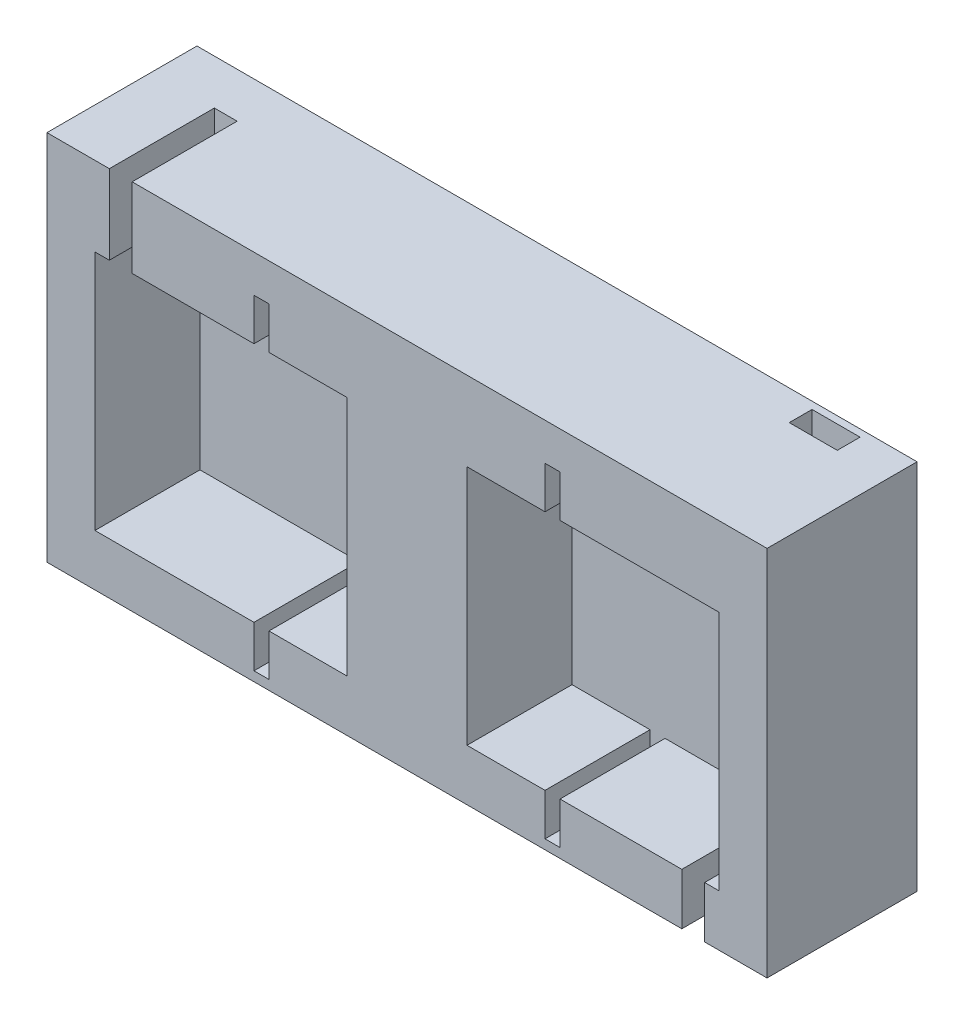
ISO-10303-21;
HEADER;
FILE_DESCRIPTION(('STEP AP214'),'2;1');
FILE_NAME('part.step','',(''),(''),'','','');
FILE_SCHEMA(('AUTOMOTIVE_DESIGN { 1 0 10303 214 1 1 1 1 }'));
ENDSEC;
DATA;
#1=APPLICATION_CONTEXT('core data for automotive mechanical design processes');
#2=APPLICATION_PROTOCOL_DEFINITION('international standard','automotive_design',2000,#1);
#3=PRODUCT_CONTEXT('',#1,'mechanical');
#4=PRODUCT('Part','Part','',(#3));
#5=PRODUCT_RELATED_PRODUCT_CATEGORY('part','',(#4));
#6=PRODUCT_DEFINITION_FORMATION('','',#4);
#7=PRODUCT_DEFINITION_CONTEXT('part definition',#1,'design');
#8=PRODUCT_DEFINITION('design','',#6,#7);
#9=PRODUCT_DEFINITION_SHAPE('','',#8);
#10=(LENGTH_UNIT() NAMED_UNIT(*) SI_UNIT(.MILLI.,.METRE.));
#11=(NAMED_UNIT(*) PLANE_ANGLE_UNIT() SI_UNIT($,.RADIAN.));
#12=(NAMED_UNIT(*) SI_UNIT($,.STERADIAN.) SOLID_ANGLE_UNIT());
#13=UNCERTAINTY_MEASURE_WITH_UNIT(LENGTH_MEASURE(1.E-05),#10,'distance_accuracy_value','');
#14=(GEOMETRIC_REPRESENTATION_CONTEXT(3) GLOBAL_UNCERTAINTY_ASSIGNED_CONTEXT((#13)) GLOBAL_UNIT_ASSIGNED_CONTEXT((#10,
#11,#12)) REPRESENTATION_CONTEXT('',''));
#15=CARTESIAN_POINT('',(0.,0.,0.));
#16=DIRECTION('',(0.,0.,1.));
#17=DIRECTION('',(1.,0.,0.));
#18=AXIS2_PLACEMENT_3D('',#15,#16,#17);
#19=CARTESIAN_POINT('',(51.7,-31.,-7.5));
#20=DIRECTION('',(1.,0.,0.));
#21=DIRECTION('',(0.,0.,-1.));
#22=AXIS2_PLACEMENT_3D('',#19,#20,#21);
#23=PLANE('',#22);
#24=DIRECTION('',(0.,-1.,0.));
#25=VECTOR('',#24,1.);
#26=CARTESIAN_POINT('',(51.7,31.,-11.3));
#27=LINE('',#26,#25);
#28=CARTESIAN_POINT('',(51.7,31.,-11.3));
#29=VERTEX_POINT('',#28);
#30=CARTESIAN_POINT('',(51.7,-31.,-11.3));
#31=VERTEX_POINT('',#30);
#32=EDGE_CURVE('E63',#29,#31,#27,.T.);
#33=ORIENTED_EDGE('',*,*,#32,.T.);
#34=DIRECTION('',(0.,0.,-1.));
#35=VECTOR('',#34,1.);
#36=CARTESIAN_POINT('',(51.7,-31.,-7.5));
#37=LINE('',#36,#35);
#38=CARTESIAN_POINT('',(51.7,-31.,-7.5));
#39=VERTEX_POINT('',#38);
#40=EDGE_CURVE('E368',#39,#31,#37,.T.);
#41=ORIENTED_EDGE('',*,*,#40,.F.);
#42=DIRECTION('',(0.,-1.,0.));
#43=VECTOR('',#42,1.);
#44=CARTESIAN_POINT('',(51.7,-31.,-7.5));
#45=LINE('',#44,#43);
#46=CARTESIAN_POINT('',(51.7,31.,-7.5));
#47=VERTEX_POINT('',#46);
#48=EDGE_CURVE('E339',#47,#39,#45,.T.);
#49=ORIENTED_EDGE('',*,*,#48,.F.);
#50=DIRECTION('',(0.,0.,-1.));
#51=VECTOR('',#50,1.);
#52=CARTESIAN_POINT('',(51.7,31.,-7.5));
#53=LINE('',#52,#51);
#54=EDGE_CURVE('E58',#47,#29,#53,.T.);
#55=ORIENTED_EDGE('',*,*,#54,.T.);
#56=EDGE_LOOP('',(#33,#41,#49,#55));
#57=FACE_BOUND('',#56,.T.);
#58=ADVANCED_FACE('F41',(#57),#23,.F.);
#59=CARTESIAN_POINT('',(43.7,31.,-7.5));
#60=DIRECTION('',(-1.,0.,0.));
#61=DIRECTION('',(0.,-1.,0.));
#62=AXIS2_PLACEMENT_3D('',#59,#60,#61);
#63=PLANE('',#62);
#64=DIRECTION('',(0.,1.,0.));
#65=VECTOR('',#64,1.);
#66=CARTESIAN_POINT('',(43.7,-31.,-11.3));
#67=LINE('',#66,#65);
#68=CARTESIAN_POINT('',(43.7,-31.,-11.3));
#69=VERTEX_POINT('',#68);
#70=CARTESIAN_POINT('',(43.7,31.,-11.3));
#71=VERTEX_POINT('',#70);
#72=EDGE_CURVE('E1329',#69,#71,#67,.T.);
#73=ORIENTED_EDGE('',*,*,#72,.T.);
#74=DIRECTION('',(0.,0.,-1.));
#75=VECTOR('',#74,1.);
#76=CARTESIAN_POINT('',(43.7,31.,-7.5));
#77=LINE('',#76,#75);
#78=CARTESIAN_POINT('',(43.7,31.,-7.5));
#79=VERTEX_POINT('',#78);
#80=EDGE_CURVE('E330',#79,#71,#77,.T.);
#81=ORIENTED_EDGE('',*,*,#80,.F.);
#82=DIRECTION('',(0.,1.,0.));
#83=VECTOR('',#82,1.);
#84=CARTESIAN_POINT('',(43.7,31.,-7.5));
#85=LINE('',#84,#83);
#86=CARTESIAN_POINT('',(43.7,-31.,-7.5));
#87=VERTEX_POINT('',#86);
#88=EDGE_CURVE('E323',#87,#79,#85,.T.);
#89=ORIENTED_EDGE('',*,*,#88,.F.);
#90=DIRECTION('',(0.,0.,-1.));
#91=VECTOR('',#90,1.);
#92=CARTESIAN_POINT('',(43.7,-31.,-7.5));
#93=LINE('',#92,#91);
#94=EDGE_CURVE('E327',#87,#69,#93,.T.);
#95=ORIENTED_EDGE('',*,*,#94,.T.);
#96=EDGE_LOOP('',(#73,#81,#89,#95));
#97=FACE_BOUND('',#96,.T.);
#98=ADVANCED_FACE('F325',(#97),#63,.F.);
#99=CARTESIAN_POINT('',(0.,31.,-12.5));
#100=DIRECTION('',(0.,-1.,0.));
#101=DIRECTION('',(0.,0.,-1.));
#102=AXIS2_PLACEMENT_3D('',#99,#100,#101);
#103=PLANE('',#102);
#104=DIRECTION('',(0.,0.,1.));
#105=VECTOR('',#104,1.);
#106=CARTESIAN_POINT('',(60.,31.,-12.5));
#107=LINE('',#106,#105);
#108=CARTESIAN_POINT('',(60.,31.,-12.5));
#109=VERTEX_POINT('',#108);
#110=CARTESIAN_POINT('',(60.,31.,12.5));
#111=VERTEX_POINT('',#110);
#112=EDGE_CURVE('E50',#109,#111,#107,.T.);
#113=ORIENTED_EDGE('',*,*,#112,.F.);
#114=DIRECTION('',(1.,0.,0.));
#115=VECTOR('',#114,1.);
#116=CARTESIAN_POINT('',(0.,31.,-12.5));
#117=LINE('',#116,#115);
#118=CARTESIAN_POINT('',(-60.,31.,-12.5));
#119=VERTEX_POINT('',#118);
#120=EDGE_CURVE('E630',#119,#109,#117,.T.);
#121=ORIENTED_EDGE('',*,*,#120,.F.);
#122=DIRECTION('',(0.,0.,1.));
#123=VECTOR('',#122,1.);
#124=CARTESIAN_POINT('',(-60.,31.,-12.5));
#125=LINE('',#124,#123);
#126=CARTESIAN_POINT('',(-60.,31.,12.5));
#127=VERTEX_POINT('',#126);
#128=EDGE_CURVE('E11',#119,#127,#125,.T.);
#129=ORIENTED_EDGE('',*,*,#128,.T.);
#130=DIRECTION('',(1.,0.,0.));
#131=VECTOR('',#130,1.);
#132=CARTESIAN_POINT('',(0.,31.,12.5));
#133=LINE('',#132,#131);
#134=CARTESIAN_POINT('',(-49.6,31.,12.5));
#135=VERTEX_POINT('',#134);
#136=EDGE_CURVE('E625',#127,#135,#133,.T.);
#137=ORIENTED_EDGE('',*,*,#136,.T.);
#138=DIRECTION('',(0.,0.,-1.));
#139=VECTOR('',#138,1.);
#140=CARTESIAN_POINT('',(-49.6,31.,12.5));
#141=LINE('',#140,#139);
#142=CARTESIAN_POINT('',(-49.6,31.,-5.));
#143=VERTEX_POINT('',#142);
#144=EDGE_CURVE('E492',#135,#143,#141,.T.);
#145=ORIENTED_EDGE('',*,*,#144,.T.);
#146=DIRECTION('',(1.,0.,0.));
#147=VECTOR('',#146,1.);
#148=CARTESIAN_POINT('',(0.,31.,-5.));
#149=LINE('',#148,#147);
#150=CARTESIAN_POINT('',(-45.8,31.,-5.));
#151=VERTEX_POINT('',#150);
#152=EDGE_CURVE('E393',#143,#151,#149,.T.);
#153=ORIENTED_EDGE('',*,*,#152,.T.);
#154=DIRECTION('',(0.,0.,-1.));
#155=VECTOR('',#154,1.);
#156=CARTESIAN_POINT('',(-45.8,31.,12.5));
#157=LINE('',#156,#155);
#158=CARTESIAN_POINT('',(-45.8,31.,12.5));
#159=VERTEX_POINT('',#158);
#160=EDGE_CURVE('E495',#159,#151,#157,.T.);
#161=ORIENTED_EDGE('',*,*,#160,.F.);
#162=EDGE_CURVE('E641',#159,#111,#133,.T.);
#163=ORIENTED_EDGE('',*,*,#162,.T.);
#164=EDGE_LOOP('',(#113,#121,#129,#137,#145,#153,#161,#163));
#165=FACE_BOUND('',#164,.T.);
#166=DIRECTION('',(1.,0.,0.));
#167=VECTOR('',#166,1.);
#168=CARTESIAN_POINT('',(43.7,31.,-11.3));
#169=LINE('',#168,#167);
#170=EDGE_CURVE('E1328',#71,#29,#169,.T.);
#171=ORIENTED_EDGE('',*,*,#170,.T.);
#172=ORIENTED_EDGE('',*,*,#54,.F.);
#173=DIRECTION('',(1.,0.,0.));
#174=VECTOR('',#173,1.);
#175=CARTESIAN_POINT('',(51.7,31.,-7.5));
#176=LINE('',#175,#174);
#177=EDGE_CURVE('E333',#79,#47,#176,.T.);
#178=ORIENTED_EDGE('',*,*,#177,.F.);
#179=ORIENTED_EDGE('',*,*,#80,.T.);
#180=EDGE_LOOP('',(#171,#172,#178,#179));
#181=FACE_BOUND('',#180,.T.);
#182=ADVANCED_FACE('F738',(#165,#181),#103,.F.);
#183=CARTESIAN_POINT('',(0.,-31.,-12.5));
#184=DIRECTION('',(0.,-1.,0.));
#185=DIRECTION('',(0.,0.,-1.));
#186=AXIS2_PLACEMENT_3D('',#183,#184,#185);
#187=PLANE('',#186);
#188=DIRECTION('',(1.,0.,0.));
#189=VECTOR('',#188,1.);
#190=CARTESIAN_POINT('',(0.,-31.,-12.5));
#191=LINE('',#190,#189);
#192=CARTESIAN_POINT('',(-60.,-31.,-12.5));
#193=VERTEX_POINT('',#192);
#194=CARTESIAN_POINT('',(60.,-31.,-12.5));
#195=VERTEX_POINT('',#194);
#196=EDGE_CURVE('E624',#193,#195,#191,.T.);
#197=ORIENTED_EDGE('',*,*,#196,.T.);
#198=DIRECTION('',(0.,0.,1.));
#199=VECTOR('',#198,1.);
#200=CARTESIAN_POINT('',(60.,-31.,-12.5));
#201=LINE('',#200,#199);
#202=CARTESIAN_POINT('',(60.,-31.,12.5));
#203=VERTEX_POINT('',#202);
#204=EDGE_CURVE('E645',#195,#203,#201,.T.);
#205=ORIENTED_EDGE('',*,*,#204,.T.);
#206=DIRECTION('',(1.,0.,0.));
#207=VECTOR('',#206,1.);
#208=CARTESIAN_POINT('',(0.,-31.,12.5));
#209=LINE('',#208,#207);
#210=CARTESIAN_POINT('',(49.6,-31.,12.5));
#211=VERTEX_POINT('',#210);
#212=EDGE_CURVE('E634',#211,#203,#209,.T.);
#213=ORIENTED_EDGE('',*,*,#212,.F.);
#214=DIRECTION('',(0.,0.,-1.));
#215=VECTOR('',#214,1.);
#216=CARTESIAN_POINT('',(49.6,-31.,12.5));
#217=LINE('',#216,#215);
#218=CARTESIAN_POINT('',(49.6,-31.,-5.));
#219=VERTEX_POINT('',#218);
#220=EDGE_CURVE('E615',#211,#219,#217,.T.);
#221=ORIENTED_EDGE('',*,*,#220,.T.);
#222=DIRECTION('',(1.,0.,0.));
#223=VECTOR('',#222,1.);
#224=CARTESIAN_POINT('',(0.,-31.,-5.));
#225=LINE('',#224,#223);
#226=CARTESIAN_POINT('',(45.8,-31.,-5.));
#227=VERTEX_POINT('',#226);
#228=EDGE_CURVE('E505',#227,#219,#225,.T.);
#229=ORIENTED_EDGE('',*,*,#228,.F.);
#230=DIRECTION('',(0.,0.,-1.));
#231=VECTOR('',#230,1.);
#232=CARTESIAN_POINT('',(45.8,-31.,12.5));
#233=LINE('',#232,#231);
#234=CARTESIAN_POINT('',(45.8,-31.,12.5));
#235=VERTEX_POINT('',#234);
#236=EDGE_CURVE('E618',#235,#227,#233,.T.);
#237=ORIENTED_EDGE('',*,*,#236,.F.);
#238=CARTESIAN_POINT('',(-60.,-31.,12.5));
#239=VERTEX_POINT('',#238);
#240=EDGE_CURVE('E635',#239,#235,#209,.T.);
#241=ORIENTED_EDGE('',*,*,#240,.F.);
#242=DIRECTION('',(0.,0.,1.));
#243=VECTOR('',#242,1.);
#244=CARTESIAN_POINT('',(-60.,-31.,-12.5));
#245=LINE('',#244,#243);
#246=EDGE_CURVE('E45',#193,#239,#245,.T.);
#247=ORIENTED_EDGE('',*,*,#246,.F.);
#248=EDGE_LOOP('',(#197,#205,#213,#221,#229,#237,#241,#247));
#249=FACE_BOUND('',#248,.T.);
#250=ORIENTED_EDGE('',*,*,#40,.T.);
#251=DIRECTION('',(-1.,0.,0.));
#252=VECTOR('',#251,1.);
#253=CARTESIAN_POINT('',(51.7,-31.,-11.3));
#254=LINE('',#253,#252);
#255=EDGE_CURVE('E346',#31,#69,#254,.T.);
#256=ORIENTED_EDGE('',*,*,#255,.T.);
#257=ORIENTED_EDGE('',*,*,#94,.F.);
#258=DIRECTION('',(-1.,0.,0.));
#259=VECTOR('',#258,1.);
#260=CARTESIAN_POINT('',(51.7,-31.,-7.5));
#261=LINE('',#260,#259);
#262=EDGE_CURVE('E334',#39,#87,#261,.T.);
#263=ORIENTED_EDGE('',*,*,#262,.F.);
#264=EDGE_LOOP('',(#250,#256,#257,#263));
#265=FACE_BOUND('',#264,.T.);
#266=DIRECTION('',(1.,0.,0.));
#267=VECTOR('',#266,1.);
#268=CARTESIAN_POINT('',(0.,-31.,5.));
#269=LINE('',#268,#267);
#270=CARTESIAN_POINT('',(-7.5,-31.,5.));
#271=VERTEX_POINT('',#270);
#272=CARTESIAN_POINT('',(7.5,-31.,5.));
#273=VERTEX_POINT('',#272);
#274=EDGE_CURVE('E358',#271,#273,#269,.T.);
#275=ORIENTED_EDGE('',*,*,#274,.T.);
#276=DIRECTION('',(0.,0.,-1.));
#277=VECTOR('',#276,1.);
#278=CARTESIAN_POINT('',(7.5,-31.,5.));
#279=LINE('',#278,#277);
#280=CARTESIAN_POINT('',(7.5,-31.,0.));
#281=VERTEX_POINT('',#280);
#282=EDGE_CURVE('E379',#273,#281,#279,.T.);
#283=ORIENTED_EDGE('',*,*,#282,.T.);
#284=DIRECTION('',(1.,0.,0.));
#285=VECTOR('',#284,1.);
#286=CARTESIAN_POINT('',(0.,-31.,0.));
#287=LINE('',#286,#285);
#288=CARTESIAN_POINT('',(-7.5,-31.,0.));
#289=VERTEX_POINT('',#288);
#290=EDGE_CURVE('E370',#289,#281,#287,.T.);
#291=ORIENTED_EDGE('',*,*,#290,.F.);
#292=DIRECTION('',(0.,0.,-1.));
#293=VECTOR('',#292,1.);
#294=CARTESIAN_POINT('',(-7.5,-31.,5.));
#295=LINE('',#294,#293);
#296=EDGE_CURVE('E376',#271,#289,#295,.T.);
#297=ORIENTED_EDGE('',*,*,#296,.F.);
#298=EDGE_LOOP('',(#275,#283,#291,#297));
#299=FACE_BOUND('',#298,.T.);
#300=ADVANCED_FACE('F343',(#249,#265,#299),#187,.T.);
#301=CARTESIAN_POINT('',(0.,0.,12.5));
#302=DIRECTION('',(0.,0.,1.));
#303=DIRECTION('',(1.,0.,0.));
#304=AXIS2_PLACEMENT_3D('',#301,#302,#303);
#305=PLANE('',#304);
#306=ORIENTED_EDGE('',*,*,#162,.F.);
#307=DIRECTION('',(0.,1.,0.));
#308=VECTOR('',#307,1.);
#309=CARTESIAN_POINT('',(-45.8,0.,12.5));
#310=LINE('',#309,#308);
#311=CARTESIAN_POINT('',(-45.8,17.7825076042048,12.5));
#312=VERTEX_POINT('',#311);
#313=EDGE_CURVE('E436',#312,#159,#310,.T.);
#314=ORIENTED_EDGE('',*,*,#313,.F.);
#315=DIRECTION('',(-1.,0.,0.));
#316=VECTOR('',#315,1.);
#317=CARTESIAN_POINT('',(0.,17.7825076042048,12.5));
#318=LINE('',#317,#316);
#319=CARTESIAN_POINT('',(-25.5,17.7825076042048,12.5));
#320=VERTEX_POINT('',#319);
#321=EDGE_CURVE('E434',#320,#312,#318,.T.);
#322=ORIENTED_EDGE('',*,*,#321,.F.);
#323=DIRECTION('',(0.,-1.,0.));
#324=VECTOR('',#323,1.);
#325=CARTESIAN_POINT('',(-25.5,0.,12.5));
#326=LINE('',#325,#324);
#327=CARTESIAN_POINT('',(-25.5,24.7825076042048,12.5));
#328=VERTEX_POINT('',#327);
#329=EDGE_CURVE('E464',#328,#320,#326,.T.);
#330=ORIENTED_EDGE('',*,*,#329,.F.);
#331=DIRECTION('',(-1.,0.,0.));
#332=VECTOR('',#331,1.);
#333=CARTESIAN_POINT('',(0.,24.7825076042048,12.5));
#334=LINE('',#333,#332);
#335=CARTESIAN_POINT('',(-23.,24.7825076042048,12.5));
#336=VERTEX_POINT('',#335);
#337=EDGE_CURVE('E461',#336,#328,#334,.T.);
#338=ORIENTED_EDGE('',*,*,#337,.F.);
#339=DIRECTION('',(0.,1.,0.));
#340=VECTOR('',#339,1.);
#341=CARTESIAN_POINT('',(-23.,0.,12.5));
#342=LINE('',#341,#340);
#343=CARTESIAN_POINT('',(-23.,17.7825076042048,12.5));
#344=VERTEX_POINT('',#343);
#345=EDGE_CURVE('E459',#344,#336,#342,.T.);
#346=ORIENTED_EDGE('',*,*,#345,.F.);
#347=DIRECTION('',(-1.,0.,0.));
#348=VECTOR('',#347,1.);
#349=CARTESIAN_POINT('',(0.,17.7825076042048,12.5));
#350=LINE('',#349,#348);
#351=CARTESIAN_POINT('',(-10.,17.7825076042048,12.5));
#352=VERTEX_POINT('',#351);
#353=EDGE_CURVE('E457',#352,#344,#350,.T.);
#354=ORIENTED_EDGE('',*,*,#353,.F.);
#355=DIRECTION('',(0.,1.,0.));
#356=VECTOR('',#355,1.);
#357=CARTESIAN_POINT('',(-10.,0.,12.5));
#358=LINE('',#357,#356);
#359=CARTESIAN_POINT('',(-10.,-22.4174923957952,12.5));
#360=VERTEX_POINT('',#359);
#361=EDGE_CURVE('E455',#360,#352,#358,.T.);
#362=ORIENTED_EDGE('',*,*,#361,.F.);
#363=DIRECTION('',(1.,0.,0.));
#364=VECTOR('',#363,1.);
#365=CARTESIAN_POINT('',(0.,-22.4174923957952,12.5));
#366=LINE('',#365,#364);
#367=CARTESIAN_POINT('',(-23.,-22.4174923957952,12.5));
#368=VERTEX_POINT('',#367);
#369=EDGE_CURVE('E453',#368,#360,#366,.T.);
#370=ORIENTED_EDGE('',*,*,#369,.F.);
#371=DIRECTION('',(0.,1.,0.));
#372=VECTOR('',#371,1.);
#373=CARTESIAN_POINT('',(-23.,0.,12.5));
#374=LINE('',#373,#372);
#375=CARTESIAN_POINT('',(-23.,-29.4174923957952,12.5));
#376=VERTEX_POINT('',#375);
#377=EDGE_CURVE('E451',#376,#368,#374,.T.);
#378=ORIENTED_EDGE('',*,*,#377,.F.);
#379=DIRECTION('',(1.,0.,0.));
#380=VECTOR('',#379,1.);
#381=CARTESIAN_POINT('',(0.,-29.4174923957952,12.5));
#382=LINE('',#381,#380);
#383=CARTESIAN_POINT('',(-25.5,-29.4174923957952,12.5));
#384=VERTEX_POINT('',#383);
#385=EDGE_CURVE('E449',#384,#376,#382,.T.);
#386=ORIENTED_EDGE('',*,*,#385,.F.);
#387=DIRECTION('',(0.,-1.,0.));
#388=VECTOR('',#387,1.);
#389=CARTESIAN_POINT('',(-25.5,0.,12.5));
#390=LINE('',#389,#388);
#391=CARTESIAN_POINT('',(-25.5,-22.4174923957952,12.5));
#392=VERTEX_POINT('',#391);
#393=EDGE_CURVE('E447',#392,#384,#390,.T.);
#394=ORIENTED_EDGE('',*,*,#393,.F.);
#395=DIRECTION('',(1.,0.,0.));
#396=VECTOR('',#395,1.);
#397=CARTESIAN_POINT('',(0.,-22.4174923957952,12.5));
#398=LINE('',#397,#396);
#399=CARTESIAN_POINT('',(-52.,-22.4174923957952,12.5));
#400=VERTEX_POINT('',#399);
#401=EDGE_CURVE('E445',#400,#392,#398,.T.);
#402=ORIENTED_EDGE('',*,*,#401,.F.);
#403=DIRECTION('',(0.,-1.,0.));
#404=VECTOR('',#403,1.);
#405=CARTESIAN_POINT('',(-52.,0.,12.5));
#406=LINE('',#405,#404);
#407=CARTESIAN_POINT('',(-52.,17.7825076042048,12.5));
#408=VERTEX_POINT('',#407);
#409=EDGE_CURVE('E443',#408,#400,#406,.T.);
#410=ORIENTED_EDGE('',*,*,#409,.F.);
#411=DIRECTION('',(-1.,0.,0.));
#412=VECTOR('',#411,1.);
#413=CARTESIAN_POINT('',(0.,17.7825076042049,12.5));
#414=LINE('',#413,#412);
#415=CARTESIAN_POINT('',(-49.6,17.7825076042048,12.5));
#416=VERTEX_POINT('',#415);
#417=EDGE_CURVE('E441',#416,#408,#414,.T.);
#418=ORIENTED_EDGE('',*,*,#417,.F.);
#419=DIRECTION('',(0.,1.,0.));
#420=VECTOR('',#419,1.);
#421=CARTESIAN_POINT('',(-49.6,0.,12.5));
#422=LINE('',#421,#420);
#423=EDGE_CURVE('E438',#416,#135,#422,.T.);
#424=ORIENTED_EDGE('',*,*,#423,.T.);
#425=ORIENTED_EDGE('',*,*,#136,.F.);
#426=DIRECTION('',(0.,1.,0.));
#427=VECTOR('',#426,1.);
#428=CARTESIAN_POINT('',(-60.,0.,12.5));
#429=LINE('',#428,#427);
#430=EDGE_CURVE('E499',#239,#127,#429,.T.);
#431=ORIENTED_EDGE('',*,*,#430,.F.);
#432=ORIENTED_EDGE('',*,*,#240,.T.);
#433=DIRECTION('',(0.,-1.,0.));
#434=VECTOR('',#433,1.);
#435=CARTESIAN_POINT('',(45.8,0.,12.5));
#436=LINE('',#435,#434);
#437=CARTESIAN_POINT('',(45.8,-22.4174923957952,12.5));
#438=VERTEX_POINT('',#437);
#439=EDGE_CURVE('E549',#438,#235,#436,.T.);
#440=ORIENTED_EDGE('',*,*,#439,.F.);
#441=DIRECTION('',(-1.,0.,0.));
#442=VECTOR('',#441,1.);
#443=CARTESIAN_POINT('',(0.,-22.4174923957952,12.5));
#444=LINE('',#443,#442);
#445=CARTESIAN_POINT('',(25.5,-22.4174923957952,12.5));
#446=VERTEX_POINT('',#445);
#447=EDGE_CURVE('E546',#438,#446,#444,.T.);
#448=ORIENTED_EDGE('',*,*,#447,.T.);
#449=DIRECTION('',(0.,-1.,0.));
#450=VECTOR('',#449,1.);
#451=CARTESIAN_POINT('',(25.5,0.,12.5));
#452=LINE('',#451,#450);
#453=CARTESIAN_POINT('',(25.5,-29.4174923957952,12.5));
#454=VERTEX_POINT('',#453);
#455=EDGE_CURVE('E586',#446,#454,#452,.T.);
#456=ORIENTED_EDGE('',*,*,#455,.T.);
#457=DIRECTION('',(-1.,0.,0.));
#458=VECTOR('',#457,1.);
#459=CARTESIAN_POINT('',(0.,-29.4174923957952,12.5));
#460=LINE('',#459,#458);
#461=CARTESIAN_POINT('',(23.,-29.4174923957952,12.5));
#462=VERTEX_POINT('',#461);
#463=EDGE_CURVE('E583',#454,#462,#460,.T.);
#464=ORIENTED_EDGE('',*,*,#463,.T.);
#465=DIRECTION('',(0.,1.,0.));
#466=VECTOR('',#465,1.);
#467=CARTESIAN_POINT('',(23.,0.,12.5));
#468=LINE('',#467,#466);
#469=CARTESIAN_POINT('',(23.,-22.4174923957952,12.5));
#470=VERTEX_POINT('',#469);
#471=EDGE_CURVE('E580',#462,#470,#468,.T.);
#472=ORIENTED_EDGE('',*,*,#471,.T.);
#473=DIRECTION('',(1.,0.,0.));
#474=VECTOR('',#473,1.);
#475=CARTESIAN_POINT('',(0.,-22.4174923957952,12.5));
#476=LINE('',#475,#474);
#477=CARTESIAN_POINT('',(10.,-22.4174923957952,12.5));
#478=VERTEX_POINT('',#477);
#479=EDGE_CURVE('E578',#478,#470,#476,.T.);
#480=ORIENTED_EDGE('',*,*,#479,.F.);
#481=DIRECTION('',(0.,1.,0.));
#482=VECTOR('',#481,1.);
#483=CARTESIAN_POINT('',(10.,0.,12.5));
#484=LINE('',#483,#482);
#485=CARTESIAN_POINT('',(10.,17.7825076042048,12.5));
#486=VERTEX_POINT('',#485);
#487=EDGE_CURVE('E575',#478,#486,#484,.T.);
#488=ORIENTED_EDGE('',*,*,#487,.T.);
#489=DIRECTION('',(1.,0.,0.));
#490=VECTOR('',#489,1.);
#491=CARTESIAN_POINT('',(0.,17.7825076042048,12.5));
#492=LINE('',#491,#490);
#493=CARTESIAN_POINT('',(23.,17.7825076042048,12.5));
#494=VERTEX_POINT('',#493);
#495=EDGE_CURVE('E572',#486,#494,#492,.T.);
#496=ORIENTED_EDGE('',*,*,#495,.T.);
#497=DIRECTION('',(0.,1.,0.));
#498=VECTOR('',#497,1.);
#499=CARTESIAN_POINT('',(23.,0.,12.5));
#500=LINE('',#499,#498);
#501=CARTESIAN_POINT('',(23.,24.7825076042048,12.5));
#502=VERTEX_POINT('',#501);
#503=EDGE_CURVE('E569',#494,#502,#500,.T.);
#504=ORIENTED_EDGE('',*,*,#503,.T.);
#505=DIRECTION('',(1.,0.,0.));
#506=VECTOR('',#505,1.);
#507=CARTESIAN_POINT('',(0.,24.7825076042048,12.5));
#508=LINE('',#507,#506);
#509=CARTESIAN_POINT('',(25.5,24.7825076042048,12.5));
#510=VERTEX_POINT('',#509);
#511=EDGE_CURVE('E566',#502,#510,#508,.T.);
#512=ORIENTED_EDGE('',*,*,#511,.T.);
#513=DIRECTION('',(0.,-1.,0.));
#514=VECTOR('',#513,1.);
#515=CARTESIAN_POINT('',(25.5,0.,12.5));
#516=LINE('',#515,#514);
#517=CARTESIAN_POINT('',(25.5,17.7825076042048,12.5));
#518=VERTEX_POINT('',#517);
#519=EDGE_CURVE('E563',#510,#518,#516,.T.);
#520=ORIENTED_EDGE('',*,*,#519,.T.);
#521=DIRECTION('',(1.,0.,0.));
#522=VECTOR('',#521,1.);
#523=CARTESIAN_POINT('',(0.,17.7825076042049,12.5));
#524=LINE('',#523,#522);
#525=CARTESIAN_POINT('',(52.,17.7825076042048,12.5));
#526=VERTEX_POINT('',#525);
#527=EDGE_CURVE('E560',#518,#526,#524,.T.);
#528=ORIENTED_EDGE('',*,*,#527,.T.);
#529=DIRECTION('',(0.,-1.,0.));
#530=VECTOR('',#529,1.);
#531=CARTESIAN_POINT('',(52.,0.,12.5));
#532=LINE('',#531,#530);
#533=CARTESIAN_POINT('',(52.,-22.4174923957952,12.5));
#534=VERTEX_POINT('',#533);
#535=EDGE_CURVE('E557',#526,#534,#532,.T.);
#536=ORIENTED_EDGE('',*,*,#535,.T.);
#537=DIRECTION('',(-1.,0.,0.));
#538=VECTOR('',#537,1.);
#539=CARTESIAN_POINT('',(0.,-22.4174923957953,12.5));
#540=LINE('',#539,#538);
#541=CARTESIAN_POINT('',(49.6,-22.4174923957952,12.5));
#542=VERTEX_POINT('',#541);
#543=EDGE_CURVE('E554',#534,#542,#540,.T.);
#544=ORIENTED_EDGE('',*,*,#543,.T.);
#545=DIRECTION('',(0.,-1.,0.));
#546=VECTOR('',#545,1.);
#547=CARTESIAN_POINT('',(49.6,0.,12.5));
#548=LINE('',#547,#546);
#549=EDGE_CURVE('E551',#542,#211,#548,.T.);
#550=ORIENTED_EDGE('',*,*,#549,.T.);
#551=ORIENTED_EDGE('',*,*,#212,.T.);
#552=DIRECTION('',(0.,1.,0.));
#553=VECTOR('',#552,1.);
#554=CARTESIAN_POINT('',(60.,0.,12.5));
#555=LINE('',#554,#553);
#556=EDGE_CURVE('E638',#203,#111,#555,.T.);
#557=ORIENTED_EDGE('',*,*,#556,.T.);
#558=EDGE_LOOP('',(#306,#314,#322,#330,#338,#346,#354,#362,#370,#378,#386,#394,#402,#410,#418,
#424,#425,#431,#432,#440,#448,#456,#464,#472,#480,#488,#496,#504,#512,#520,#528,#536,#544,#550,
#551,#557));
#559=FACE_BOUND('',#558,.T.);
#560=ADVANCED_FACE('F659',(#559),#305,.T.);
#561=CARTESIAN_POINT('',(-60.,0.,-12.5));
#562=DIRECTION('',(1.,0.,0.));
#563=DIRECTION('',(0.,0.,-1.));
#564=AXIS2_PLACEMENT_3D('',#561,#562,#563);
#565=PLANE('',#564);
#566=ORIENTED_EDGE('',*,*,#430,.T.);
#567=ORIENTED_EDGE('',*,*,#128,.F.);
#568=DIRECTION('',(0.,1.,0.));
#569=VECTOR('',#568,1.);
#570=CARTESIAN_POINT('',(-60.,0.,-12.5));
#571=LINE('',#570,#569);
#572=EDGE_CURVE('E621',#193,#119,#571,.T.);
#573=ORIENTED_EDGE('',*,*,#572,.F.);
#574=ORIENTED_EDGE('',*,*,#246,.T.);
#575=EDGE_LOOP('',(#566,#567,#573,#574));
#576=FACE_BOUND('',#575,.T.);
#577=ADVANCED_FACE('F43',(#576),#565,.F.);
#578=CARTESIAN_POINT('',(60.,0.,-12.5));
#579=DIRECTION('',(1.,0.,0.));
#580=DIRECTION('',(0.,1.,0.));
#581=AXIS2_PLACEMENT_3D('',#578,#579,#580);
#582=PLANE('',#581);
#583=ORIENTED_EDGE('',*,*,#556,.F.);
#584=ORIENTED_EDGE('',*,*,#204,.F.);
#585=DIRECTION('',(0.,1.,0.));
#586=VECTOR('',#585,1.);
#587=CARTESIAN_POINT('',(60.,0.,-12.5));
#588=LINE('',#587,#586);
#589=EDGE_CURVE('E627',#195,#109,#588,.T.);
#590=ORIENTED_EDGE('',*,*,#589,.T.);
#591=ORIENTED_EDGE('',*,*,#112,.T.);
#592=EDGE_LOOP('',(#583,#584,#590,#591));
#593=FACE_BOUND('',#592,.T.);
#594=ADVANCED_FACE('F1005',(#593),#582,.T.);
#595=CARTESIAN_POINT('',(0.,0.,-12.5));
#596=DIRECTION('',(0.,0.,1.));
#597=DIRECTION('',(1.,0.,0.));
#598=AXIS2_PLACEMENT_3D('',#595,#596,#597);
#599=PLANE('',#598);
#600=ORIENTED_EDGE('',*,*,#120,.T.);
#601=ORIENTED_EDGE('',*,*,#589,.F.);
#602=ORIENTED_EDGE('',*,*,#196,.F.);
#603=ORIENTED_EDGE('',*,*,#572,.T.);
#604=EDGE_LOOP('',(#600,#601,#602,#603));
#605=FACE_BOUND('',#604,.T.);
#606=ADVANCED_FACE('F1001',(#605),#599,.F.);
#607=CARTESIAN_POINT('',(0.,-22.4174923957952,12.5));
#608=DIRECTION('',(0.,-1.,0.));
#609=DIRECTION('',(0.,0.,-1.));
#610=AXIS2_PLACEMENT_3D('',#607,#608,#609);
#611=PLANE('',#610);
#612=DIRECTION('',(0.,0.,-1.));
#613=VECTOR('',#612,1.);
#614=CARTESIAN_POINT('',(25.5,-22.4174923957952,12.5));
#615=LINE('',#614,#613);
#616=CARTESIAN_POINT('',(25.5,-22.4174923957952,-5.));
#617=VERTEX_POINT('',#616);
#618=EDGE_CURVE('E589',#446,#617,#615,.T.);
#619=ORIENTED_EDGE('',*,*,#618,.F.);
#620=ORIENTED_EDGE('',*,*,#447,.F.);
#621=DIRECTION('',(0.,0.,-1.));
#622=VECTOR('',#621,1.);
#623=CARTESIAN_POINT('',(45.8,-22.4174923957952,12.5));
#624=LINE('',#623,#622);
#625=CARTESIAN_POINT('',(45.8,-22.4174923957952,-5.));
#626=VERTEX_POINT('',#625);
#627=EDGE_CURVE('E390',#438,#626,#624,.T.);
#628=ORIENTED_EDGE('',*,*,#627,.T.);
#629=DIRECTION('',(-1.,0.,0.));
#630=VECTOR('',#629,1.);
#631=CARTESIAN_POINT('',(0.,-22.4174923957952,-5.));
#632=LINE('',#631,#630);
#633=EDGE_CURVE('E385',#626,#617,#632,.T.);
#634=ORIENTED_EDGE('',*,*,#633,.T.);
#635=EDGE_LOOP('',(#619,#620,#628,#634));
#636=FACE_BOUND('',#635,.T.);
#637=ADVANCED_FACE('F673',(#636),#611,.F.);
#638=CARTESIAN_POINT('',(45.8,0.,12.5));
#639=DIRECTION('',(1.,0.,0.));
#640=DIRECTION('',(0.,0.,-1.));
#641=AXIS2_PLACEMENT_3D('',#638,#639,#640);
#642=PLANE('',#641);
#643=ORIENTED_EDGE('',*,*,#627,.F.);
#644=ORIENTED_EDGE('',*,*,#439,.T.);
#645=ORIENTED_EDGE('',*,*,#236,.T.);
#646=DIRECTION('',(0.,-1.,0.));
#647=VECTOR('',#646,1.);
#648=CARTESIAN_POINT('',(45.8,0.,-5.));
#649=LINE('',#648,#647);
#650=EDGE_CURVE('E502',#626,#227,#649,.T.);
#651=ORIENTED_EDGE('',*,*,#650,.F.);
#652=EDGE_LOOP('',(#643,#644,#645,#651));
#653=FACE_BOUND('',#652,.T.);
#654=ADVANCED_FACE('F665',(#653),#642,.T.);
#655=CARTESIAN_POINT('',(49.6,0.,12.5));
#656=DIRECTION('',(1.,0.,0.));
#657=DIRECTION('',(0.,0.,-1.));
#658=AXIS2_PLACEMENT_3D('',#655,#656,#657);
#659=PLANE('',#658);
#660=ORIENTED_EDGE('',*,*,#220,.F.);
#661=ORIENTED_EDGE('',*,*,#549,.F.);
#662=DIRECTION('',(0.,0.,-1.));
#663=VECTOR('',#662,1.);
#664=CARTESIAN_POINT('',(49.6,-22.4174923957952,12.5));
#665=LINE('',#664,#663);
#666=CARTESIAN_POINT('',(49.6,-22.4174923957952,-5.));
#667=VERTEX_POINT('',#666);
#668=EDGE_CURVE('E613',#542,#667,#665,.T.);
#669=ORIENTED_EDGE('',*,*,#668,.T.);
#670=DIRECTION('',(0.,-1.,0.));
#671=VECTOR('',#670,1.);
#672=CARTESIAN_POINT('',(49.6,0.,-5.));
#673=LINE('',#672,#671);
#674=EDGE_CURVE('E508',#667,#219,#673,.T.);
#675=ORIENTED_EDGE('',*,*,#674,.T.);
#676=EDGE_LOOP('',(#660,#661,#669,#675));
#677=FACE_BOUND('',#676,.T.);
#678=ADVANCED_FACE('F724',(#677),#659,.F.);
#679=CARTESIAN_POINT('',(0.,-22.4174923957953,12.5));
#680=DIRECTION('',(0.,-1.,0.));
#681=DIRECTION('',(1.,0.,0.));
#682=AXIS2_PLACEMENT_3D('',#679,#680,#681);
#683=PLANE('',#682);
#684=ORIENTED_EDGE('',*,*,#668,.F.);
#685=ORIENTED_EDGE('',*,*,#543,.F.);
#686=DIRECTION('',(0.,0.,-1.));
#687=VECTOR('',#686,1.);
#688=CARTESIAN_POINT('',(52.,-22.4174923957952,12.5));
#689=LINE('',#688,#687);
#690=CARTESIAN_POINT('',(52.,-22.4174923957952,-5.));
#691=VERTEX_POINT('',#690);
#692=EDGE_CURVE('E611',#534,#691,#689,.T.);
#693=ORIENTED_EDGE('',*,*,#692,.T.);
#694=DIRECTION('',(-1.,0.,0.));
#695=VECTOR('',#694,1.);
#696=CARTESIAN_POINT('',(0.,-22.4174923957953,-5.));
#697=LINE('',#696,#695);
#698=EDGE_CURVE('E510',#691,#667,#697,.T.);
#699=ORIENTED_EDGE('',*,*,#698,.T.);
#700=EDGE_LOOP('',(#684,#685,#693,#699));
#701=FACE_BOUND('',#700,.T.);
#702=ADVANCED_FACE('F721',(#701),#683,.F.);
#703=CARTESIAN_POINT('',(52.,0.,12.5));
#704=DIRECTION('',(1.,0.,0.));
#705=DIRECTION('',(0.,1.,0.));
#706=AXIS2_PLACEMENT_3D('',#703,#704,#705);
#707=PLANE('',#706);
#708=ORIENTED_EDGE('',*,*,#692,.F.);
#709=ORIENTED_EDGE('',*,*,#535,.F.);
#710=DIRECTION('',(0.,0.,-1.));
#711=VECTOR('',#710,1.);
#712=CARTESIAN_POINT('',(52.,17.7825076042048,12.5));
#713=LINE('',#712,#711);
#714=CARTESIAN_POINT('',(52.,17.7825076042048,-5.));
#715=VERTEX_POINT('',#714);
#716=EDGE_CURVE('E609',#526,#715,#713,.T.);
#717=ORIENTED_EDGE('',*,*,#716,.T.);
#718=DIRECTION('',(0.,-1.,0.));
#719=VECTOR('',#718,1.);
#720=CARTESIAN_POINT('',(52.,0.,-5.));
#721=LINE('',#720,#719);
#722=EDGE_CURVE('E513',#715,#691,#721,.T.);
#723=ORIENTED_EDGE('',*,*,#722,.T.);
#724=EDGE_LOOP('',(#708,#709,#717,#723));
#725=FACE_BOUND('',#724,.T.);
#726=ADVANCED_FACE('F717',(#725),#707,.F.);
#727=CARTESIAN_POINT('',(0.,17.7825076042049,12.5));
#728=DIRECTION('',(0.,1.,0.));
#729=DIRECTION('',(-1.,0.,0.));
#730=AXIS2_PLACEMENT_3D('',#727,#728,#729);
#731=PLANE('',#730);
#732=ORIENTED_EDGE('',*,*,#716,.F.);
#733=ORIENTED_EDGE('',*,*,#527,.F.);
#734=DIRECTION('',(0.,0.,-1.));
#735=VECTOR('',#734,1.);
#736=CARTESIAN_POINT('',(25.5,17.7825076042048,12.5));
#737=LINE('',#736,#735);
#738=CARTESIAN_POINT('',(25.5,17.7825076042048,-5.));
#739=VERTEX_POINT('',#738);
#740=EDGE_CURVE('E607',#518,#739,#737,.T.);
#741=ORIENTED_EDGE('',*,*,#740,.T.);
#742=DIRECTION('',(1.,0.,0.));
#743=VECTOR('',#742,1.);
#744=CARTESIAN_POINT('',(0.,17.7825076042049,-5.));
#745=LINE('',#744,#743);
#746=EDGE_CURVE('E516',#739,#715,#745,.T.);
#747=ORIENTED_EDGE('',*,*,#746,.T.);
#748=EDGE_LOOP('',(#732,#733,#741,#747));
#749=FACE_BOUND('',#748,.T.);
#750=ADVANCED_FACE('F713',(#749),#731,.F.);
#751=CARTESIAN_POINT('',(25.5,0.,12.5));
#752=DIRECTION('',(1.,0.,0.));
#753=DIRECTION('',(0.,1.,0.));
#754=AXIS2_PLACEMENT_3D('',#751,#752,#753);
#755=PLANE('',#754);
#756=ORIENTED_EDGE('',*,*,#740,.F.);
#757=ORIENTED_EDGE('',*,*,#519,.F.);
#758=DIRECTION('',(0.,0.,-1.));
#759=VECTOR('',#758,1.);
#760=CARTESIAN_POINT('',(25.5,24.7825076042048,12.5));
#761=LINE('',#760,#759);
#762=CARTESIAN_POINT('',(25.5,24.7825076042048,-5.));
#763=VERTEX_POINT('',#762);
#764=EDGE_CURVE('E605',#510,#763,#761,.T.);
#765=ORIENTED_EDGE('',*,*,#764,.T.);
#766=DIRECTION('',(0.,-1.,0.));
#767=VECTOR('',#766,1.);
#768=CARTESIAN_POINT('',(25.5,0.,-5.));
#769=LINE('',#768,#767);
#770=EDGE_CURVE('E519',#763,#739,#769,.T.);
#771=ORIENTED_EDGE('',*,*,#770,.T.);
#772=EDGE_LOOP('',(#756,#757,#765,#771));
#773=FACE_BOUND('',#772,.T.);
#774=ADVANCED_FACE('F709',(#773),#755,.F.);
#775=CARTESIAN_POINT('',(0.,24.7825076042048,12.5));
#776=DIRECTION('',(0.,1.,0.));
#777=DIRECTION('',(0.,0.,1.));
#778=AXIS2_PLACEMENT_3D('',#775,#776,#777);
#779=PLANE('',#778);
#780=ORIENTED_EDGE('',*,*,#764,.F.);
#781=ORIENTED_EDGE('',*,*,#511,.F.);
#782=DIRECTION('',(0.,0.,-1.));
#783=VECTOR('',#782,1.);
#784=CARTESIAN_POINT('',(23.,24.7825076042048,12.5));
#785=LINE('',#784,#783);
#786=CARTESIAN_POINT('',(23.,24.7825076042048,-5.));
#787=VERTEX_POINT('',#786);
#788=EDGE_CURVE('E603',#502,#787,#785,.T.);
#789=ORIENTED_EDGE('',*,*,#788,.T.);
#790=DIRECTION('',(1.,0.,0.));
#791=VECTOR('',#790,1.);
#792=CARTESIAN_POINT('',(0.,24.7825076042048,-5.));
#793=LINE('',#792,#791);
#794=EDGE_CURVE('E522',#787,#763,#793,.T.);
#795=ORIENTED_EDGE('',*,*,#794,.T.);
#796=EDGE_LOOP('',(#780,#781,#789,#795));
#797=FACE_BOUND('',#796,.T.);
#798=ADVANCED_FACE('F705',(#797),#779,.F.);
#799=CARTESIAN_POINT('',(23.,0.,12.5));
#800=DIRECTION('',(-1.,0.,0.));
#801=DIRECTION('',(0.,0.,1.));
#802=AXIS2_PLACEMENT_3D('',#799,#800,#801);
#803=PLANE('',#802);
#804=ORIENTED_EDGE('',*,*,#788,.F.);
#805=ORIENTED_EDGE('',*,*,#503,.F.);
#806=DIRECTION('',(0.,0.,-1.));
#807=VECTOR('',#806,1.);
#808=CARTESIAN_POINT('',(23.,17.7825076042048,12.5));
#809=LINE('',#808,#807);
#810=CARTESIAN_POINT('',(23.,17.7825076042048,-5.));
#811=VERTEX_POINT('',#810);
#812=EDGE_CURVE('E601',#494,#811,#809,.T.);
#813=ORIENTED_EDGE('',*,*,#812,.T.);
#814=DIRECTION('',(0.,1.,0.));
#815=VECTOR('',#814,1.);
#816=CARTESIAN_POINT('',(23.,0.,-5.));
#817=LINE('',#816,#815);
#818=EDGE_CURVE('E525',#811,#787,#817,.T.);
#819=ORIENTED_EDGE('',*,*,#818,.T.);
#820=EDGE_LOOP('',(#804,#805,#813,#819));
#821=FACE_BOUND('',#820,.T.);
#822=ADVANCED_FACE('F701',(#821),#803,.F.);
#823=CARTESIAN_POINT('',(0.,17.7825076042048,12.5));
#824=DIRECTION('',(0.,1.,0.));
#825=DIRECTION('',(-1.,0.,0.));
#826=AXIS2_PLACEMENT_3D('',#823,#824,#825);
#827=PLANE('',#826);
#828=ORIENTED_EDGE('',*,*,#812,.F.);
#829=ORIENTED_EDGE('',*,*,#495,.F.);
#830=DIRECTION('',(0.,0.,-1.));
#831=VECTOR('',#830,1.);
#832=CARTESIAN_POINT('',(10.,17.7825076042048,12.5));
#833=LINE('',#832,#831);
#834=CARTESIAN_POINT('',(10.,17.7825076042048,-5.));
#835=VERTEX_POINT('',#834);
#836=EDGE_CURVE('E599',#486,#835,#833,.T.);
#837=ORIENTED_EDGE('',*,*,#836,.T.);
#838=DIRECTION('',(1.,0.,0.));
#839=VECTOR('',#838,1.);
#840=CARTESIAN_POINT('',(0.,17.7825076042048,-5.));
#841=LINE('',#840,#839);
#842=EDGE_CURVE('E528',#835,#811,#841,.T.);
#843=ORIENTED_EDGE('',*,*,#842,.T.);
#844=EDGE_LOOP('',(#828,#829,#837,#843));
#845=FACE_BOUND('',#844,.T.);
#846=ADVANCED_FACE('F697',(#845),#827,.F.);
#847=CARTESIAN_POINT('',(10.,0.,12.5));
#848=DIRECTION('',(-1.,0.,0.));
#849=DIRECTION('',(0.,-1.,0.));
#850=AXIS2_PLACEMENT_3D('',#847,#848,#849);
#851=PLANE('',#850);
#852=ORIENTED_EDGE('',*,*,#836,.F.);
#853=ORIENTED_EDGE('',*,*,#487,.F.);
#854=DIRECTION('',(0.,0.,-1.));
#855=VECTOR('',#854,1.);
#856=CARTESIAN_POINT('',(10.,-22.4174923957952,12.5));
#857=LINE('',#856,#855);
#858=CARTESIAN_POINT('',(10.,-22.4174923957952,-5.));
#859=VERTEX_POINT('',#858);
#860=EDGE_CURVE('E597',#478,#859,#857,.T.);
#861=ORIENTED_EDGE('',*,*,#860,.T.);
#862=DIRECTION('',(0.,1.,0.));
#863=VECTOR('',#862,1.);
#864=CARTESIAN_POINT('',(10.,0.,-5.));
#865=LINE('',#864,#863);
#866=EDGE_CURVE('E531',#859,#835,#865,.T.);
#867=ORIENTED_EDGE('',*,*,#866,.T.);
#868=EDGE_LOOP('',(#852,#853,#861,#867));
#869=FACE_BOUND('',#868,.T.);
#870=ADVANCED_FACE('F693',(#869),#851,.F.);
#871=CARTESIAN_POINT('',(0.,-22.4174923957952,12.5));
#872=DIRECTION('',(0.,1.,0.));
#873=DIRECTION('',(0.,0.,1.));
#874=AXIS2_PLACEMENT_3D('',#871,#872,#873);
#875=PLANE('',#874);
#876=ORIENTED_EDGE('',*,*,#860,.F.);
#877=ORIENTED_EDGE('',*,*,#479,.T.);
#878=DIRECTION('',(0.,0.,-1.));
#879=VECTOR('',#878,1.);
#880=CARTESIAN_POINT('',(23.,-22.4174923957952,12.5));
#881=LINE('',#880,#879);
#882=CARTESIAN_POINT('',(23.,-22.4174923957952,-5.));
#883=VERTEX_POINT('',#882);
#884=EDGE_CURVE('E595',#470,#883,#881,.T.);
#885=ORIENTED_EDGE('',*,*,#884,.T.);
#886=DIRECTION('',(1.,0.,0.));
#887=VECTOR('',#886,1.);
#888=CARTESIAN_POINT('',(0.,-22.4174923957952,-5.));
#889=LINE('',#888,#887);
#890=EDGE_CURVE('E534',#859,#883,#889,.T.);
#891=ORIENTED_EDGE('',*,*,#890,.F.);
#892=EDGE_LOOP('',(#876,#877,#885,#891));
#893=FACE_BOUND('',#892,.T.);
#894=ADVANCED_FACE('F689',(#893),#875,.T.);
#895=CARTESIAN_POINT('',(23.,0.,12.5));
#896=DIRECTION('',(-1.,0.,0.));
#897=DIRECTION('',(0.,-1.,0.));
#898=AXIS2_PLACEMENT_3D('',#895,#896,#897);
#899=PLANE('',#898);
#900=ORIENTED_EDGE('',*,*,#884,.F.);
#901=ORIENTED_EDGE('',*,*,#471,.F.);
#902=DIRECTION('',(0.,0.,-1.));
#903=VECTOR('',#902,1.);
#904=CARTESIAN_POINT('',(23.,-29.4174923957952,12.5));
#905=LINE('',#904,#903);
#906=CARTESIAN_POINT('',(23.,-29.4174923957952,-5.));
#907=VERTEX_POINT('',#906);
#908=EDGE_CURVE('E593',#462,#907,#905,.T.);
#909=ORIENTED_EDGE('',*,*,#908,.T.);
#910=DIRECTION('',(0.,1.,0.));
#911=VECTOR('',#910,1.);
#912=CARTESIAN_POINT('',(23.,0.,-5.));
#913=LINE('',#912,#911);
#914=EDGE_CURVE('E537',#907,#883,#913,.T.);
#915=ORIENTED_EDGE('',*,*,#914,.T.);
#916=EDGE_LOOP('',(#900,#901,#909,#915));
#917=FACE_BOUND('',#916,.T.);
#918=ADVANCED_FACE('F685',(#917),#899,.F.);
#919=CARTESIAN_POINT('',(0.,-29.4174923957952,12.5));
#920=DIRECTION('',(0.,-1.,0.));
#921=DIRECTION('',(0.,0.,-1.));
#922=AXIS2_PLACEMENT_3D('',#919,#920,#921);
#923=PLANE('',#922);
#924=ORIENTED_EDGE('',*,*,#908,.F.);
#925=ORIENTED_EDGE('',*,*,#463,.F.);
#926=DIRECTION('',(0.,0.,-1.));
#927=VECTOR('',#926,1.);
#928=CARTESIAN_POINT('',(25.5,-29.4174923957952,12.5));
#929=LINE('',#928,#927);
#930=CARTESIAN_POINT('',(25.5,-29.4174923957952,-5.));
#931=VERTEX_POINT('',#930);
#932=EDGE_CURVE('E591',#454,#931,#929,.T.);
#933=ORIENTED_EDGE('',*,*,#932,.T.);
#934=DIRECTION('',(-1.,0.,0.));
#935=VECTOR('',#934,1.);
#936=CARTESIAN_POINT('',(0.,-29.4174923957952,-5.));
#937=LINE('',#936,#935);
#938=EDGE_CURVE('E540',#931,#907,#937,.T.);
#939=ORIENTED_EDGE('',*,*,#938,.T.);
#940=EDGE_LOOP('',(#924,#925,#933,#939));
#941=FACE_BOUND('',#940,.T.);
#942=ADVANCED_FACE('F680',(#941),#923,.F.);
#943=CARTESIAN_POINT('',(25.5,0.,12.5));
#944=DIRECTION('',(1.,0.,0.));
#945=DIRECTION('',(0.,0.,-1.));
#946=AXIS2_PLACEMENT_3D('',#943,#944,#945);
#947=PLANE('',#946);
#948=ORIENTED_EDGE('',*,*,#932,.F.);
#949=ORIENTED_EDGE('',*,*,#455,.F.);
#950=ORIENTED_EDGE('',*,*,#618,.T.);
#951=DIRECTION('',(0.,-1.,0.));
#952=VECTOR('',#951,1.);
#953=CARTESIAN_POINT('',(25.5,0.,-5.));
#954=LINE('',#953,#952);
#955=EDGE_CURVE('E543',#617,#931,#954,.T.);
#956=ORIENTED_EDGE('',*,*,#955,.T.);
#957=EDGE_LOOP('',(#948,#949,#950,#956));
#958=FACE_BOUND('',#957,.T.);
#959=ADVANCED_FACE('F678',(#958),#947,.F.);
#960=CARTESIAN_POINT('',(0.,0.,-5.));
#961=DIRECTION('',(0.,0.,1.));
#962=DIRECTION('',(1.,0.,0.));
#963=AXIS2_PLACEMENT_3D('',#960,#961,#962);
#964=PLANE('',#963);
#965=ORIENTED_EDGE('',*,*,#633,.F.);
#966=ORIENTED_EDGE('',*,*,#650,.T.);
#967=ORIENTED_EDGE('',*,*,#228,.T.);
#968=ORIENTED_EDGE('',*,*,#674,.F.);
#969=ORIENTED_EDGE('',*,*,#698,.F.);
#970=ORIENTED_EDGE('',*,*,#722,.F.);
#971=ORIENTED_EDGE('',*,*,#746,.F.);
#972=ORIENTED_EDGE('',*,*,#770,.F.);
#973=ORIENTED_EDGE('',*,*,#794,.F.);
#974=ORIENTED_EDGE('',*,*,#818,.F.);
#975=ORIENTED_EDGE('',*,*,#842,.F.);
#976=ORIENTED_EDGE('',*,*,#866,.F.);
#977=ORIENTED_EDGE('',*,*,#890,.T.);
#978=ORIENTED_EDGE('',*,*,#914,.F.);
#979=ORIENTED_EDGE('',*,*,#938,.F.);
#980=ORIENTED_EDGE('',*,*,#955,.F.);
#981=EDGE_LOOP('',(#965,#966,#967,#968,#969,#970,#971,#972,#973,#974,#975,#976,#977,#978,#979,#980));
#982=FACE_BOUND('',#981,.T.);
#983=ADVANCED_FACE('F668',(#982),#964,.T.);
#984=CARTESIAN_POINT('',(0.,17.7825076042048,12.5));
#985=DIRECTION('',(0.,-1.,0.));
#986=DIRECTION('',(0.,0.,-1.));
#987=AXIS2_PLACEMENT_3D('',#984,#985,#986);
#988=PLANE('',#987);
#989=DIRECTION('',(0.,0.,-1.));
#990=VECTOR('',#989,1.);
#991=CARTESIAN_POINT('',(-25.5,17.7825076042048,12.5));
#992=LINE('',#991,#990);
#993=CARTESIAN_POINT('',(-25.5,17.7825076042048,-5.));
#994=VERTEX_POINT('',#993);
#995=EDGE_CURVE('E466',#320,#994,#992,.T.);
#996=ORIENTED_EDGE('',*,*,#995,.F.);
#997=ORIENTED_EDGE('',*,*,#321,.T.);
#998=DIRECTION('',(0.,0.,-1.));
#999=VECTOR('',#998,1.);
#1000=CARTESIAN_POINT('',(-45.8,17.7825076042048,12.5));
#1001=LINE('',#1000,#999);
#1002=CARTESIAN_POINT('',(-45.8,17.7825076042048,-5.));
#1003=VERTEX_POINT('',#1002);
#1004=EDGE_CURVE('E497',#312,#1003,#1001,.T.);
#1005=ORIENTED_EDGE('',*,*,#1004,.T.);
#1006=DIRECTION('',(-1.,0.,0.));
#1007=VECTOR('',#1006,1.);
#1008=CARTESIAN_POINT('',(0.,17.7825076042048,-5.));
#1009=LINE('',#1008,#1007);
#1010=EDGE_CURVE('E386',#994,#1003,#1009,.T.);
#1011=ORIENTED_EDGE('',*,*,#1010,.F.);
#1012=EDGE_LOOP('',(#996,#997,#1005,#1011));
#1013=FACE_BOUND('',#1012,.T.);
#1014=ADVANCED_FACE('F822',(#1013),#988,.T.);
#1015=CARTESIAN_POINT('',(-45.8,0.,12.5));
#1016=DIRECTION('',(-1.,0.,0.));
#1017=DIRECTION('',(0.,0.,1.));
#1018=AXIS2_PLACEMENT_3D('',#1015,#1016,#1017);
#1019=PLANE('',#1018);
#1020=ORIENTED_EDGE('',*,*,#1004,.F.);
#1021=ORIENTED_EDGE('',*,*,#313,.T.);
#1022=ORIENTED_EDGE('',*,*,#160,.T.);
#1023=DIRECTION('',(0.,1.,0.));
#1024=VECTOR('',#1023,1.);
#1025=CARTESIAN_POINT('',(-45.8,0.,-5.));
#1026=LINE('',#1025,#1024);
#1027=EDGE_CURVE('E389',#1003,#151,#1026,.T.);
#1028=ORIENTED_EDGE('',*,*,#1027,.F.);
#1029=EDGE_LOOP('',(#1020,#1021,#1022,#1028));
#1030=FACE_BOUND('',#1029,.T.);
#1031=ADVANCED_FACE('F818',(#1030),#1019,.T.);
#1032=CARTESIAN_POINT('',(-49.6,0.,12.5));
#1033=DIRECTION('',(-1.,0.,0.));
#1034=DIRECTION('',(0.,0.,1.));
#1035=AXIS2_PLACEMENT_3D('',#1032,#1033,#1034);
#1036=PLANE('',#1035);
#1037=ORIENTED_EDGE('',*,*,#144,.F.);
#1038=ORIENTED_EDGE('',*,*,#423,.F.);
#1039=DIRECTION('',(0.,0.,-1.));
#1040=VECTOR('',#1039,1.);
#1041=CARTESIAN_POINT('',(-49.6,17.7825076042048,12.5));
#1042=LINE('',#1041,#1040);
#1043=CARTESIAN_POINT('',(-49.6,17.7825076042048,-5.));
#1044=VERTEX_POINT('',#1043);
#1045=EDGE_CURVE('E490',#416,#1044,#1042,.T.);
#1046=ORIENTED_EDGE('',*,*,#1045,.T.);
#1047=DIRECTION('',(0.,1.,0.));
#1048=VECTOR('',#1047,1.);
#1049=CARTESIAN_POINT('',(-49.6,0.,-5.));
#1050=LINE('',#1049,#1048);
#1051=EDGE_CURVE('E396',#1044,#143,#1050,.T.);
#1052=ORIENTED_EDGE('',*,*,#1051,.T.);
#1053=EDGE_LOOP('',(#1037,#1038,#1046,#1052));
#1054=FACE_BOUND('',#1053,.T.);
#1055=ADVANCED_FACE('F814',(#1054),#1036,.F.);
#1056=CARTESIAN_POINT('',(0.,17.7825076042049,12.5));
#1057=DIRECTION('',(0.,-1.,0.));
#1058=DIRECTION('',(1.,0.,0.));
#1059=AXIS2_PLACEMENT_3D('',#1056,#1057,#1058);
#1060=PLANE('',#1059);
#1061=ORIENTED_EDGE('',*,*,#1045,.F.);
#1062=ORIENTED_EDGE('',*,*,#417,.T.);
#1063=DIRECTION('',(0.,0.,-1.));
#1064=VECTOR('',#1063,1.);
#1065=CARTESIAN_POINT('',(-52.,17.7825076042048,12.5));
#1066=LINE('',#1065,#1064);
#1067=CARTESIAN_POINT('',(-52.,17.7825076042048,-5.));
#1068=VERTEX_POINT('',#1067);
#1069=EDGE_CURVE('E488',#408,#1068,#1066,.T.);
#1070=ORIENTED_EDGE('',*,*,#1069,.T.);
#1071=DIRECTION('',(-1.,0.,0.));
#1072=VECTOR('',#1071,1.);
#1073=CARTESIAN_POINT('',(0.,17.7825076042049,-5.));
#1074=LINE('',#1073,#1072);
#1075=EDGE_CURVE('E398',#1044,#1068,#1074,.T.);
#1076=ORIENTED_EDGE('',*,*,#1075,.F.);
#1077=EDGE_LOOP('',(#1061,#1062,#1070,#1076));
#1078=FACE_BOUND('',#1077,.T.);
#1079=ADVANCED_FACE('F810',(#1078),#1060,.T.);
#1080=CARTESIAN_POINT('',(-52.,0.,12.5));
#1081=DIRECTION('',(1.,0.,0.));
#1082=DIRECTION('',(0.,1.,0.));
#1083=AXIS2_PLACEMENT_3D('',#1080,#1081,#1082);
#1084=PLANE('',#1083);
#1085=ORIENTED_EDGE('',*,*,#1069,.F.);
#1086=ORIENTED_EDGE('',*,*,#409,.T.);
#1087=DIRECTION('',(0.,0.,-1.));
#1088=VECTOR('',#1087,1.);
#1089=CARTESIAN_POINT('',(-52.,-22.4174923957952,12.5));
#1090=LINE('',#1089,#1088);
#1091=CARTESIAN_POINT('',(-52.,-22.4174923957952,-5.));
#1092=VERTEX_POINT('',#1091);
#1093=EDGE_CURVE('E486',#400,#1092,#1090,.T.);
#1094=ORIENTED_EDGE('',*,*,#1093,.T.);
#1095=DIRECTION('',(0.,-1.,0.));
#1096=VECTOR('',#1095,1.);
#1097=CARTESIAN_POINT('',(-52.,0.,-5.));
#1098=LINE('',#1097,#1096);
#1099=EDGE_CURVE('E401',#1068,#1092,#1098,.T.);
#1100=ORIENTED_EDGE('',*,*,#1099,.F.);
#1101=EDGE_LOOP('',(#1085,#1086,#1094,#1100));
#1102=FACE_BOUND('',#1101,.T.);
#1103=ADVANCED_FACE('F806',(#1102),#1084,.T.);
#1104=CARTESIAN_POINT('',(0.,-22.4174923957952,12.5));
#1105=DIRECTION('',(0.,1.,0.));
#1106=DIRECTION('',(0.,0.,1.));
#1107=AXIS2_PLACEMENT_3D('',#1104,#1105,#1106);
#1108=PLANE('',#1107);
#1109=ORIENTED_EDGE('',*,*,#1093,.F.);
#1110=ORIENTED_EDGE('',*,*,#401,.T.);
#1111=DIRECTION('',(0.,0.,-1.));
#1112=VECTOR('',#1111,1.);
#1113=CARTESIAN_POINT('',(-25.5,-22.4174923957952,12.5));
#1114=LINE('',#1113,#1112);
#1115=CARTESIAN_POINT('',(-25.5,-22.4174923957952,-5.));
#1116=VERTEX_POINT('',#1115);
#1117=EDGE_CURVE('E484',#392,#1116,#1114,.T.);
#1118=ORIENTED_EDGE('',*,*,#1117,.T.);
#1119=DIRECTION('',(1.,0.,0.));
#1120=VECTOR('',#1119,1.);
#1121=CARTESIAN_POINT('',(0.,-22.4174923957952,-5.));
#1122=LINE('',#1121,#1120);
#1123=EDGE_CURVE('E404',#1092,#1116,#1122,.T.);
#1124=ORIENTED_EDGE('',*,*,#1123,.F.);
#1125=EDGE_LOOP('',(#1109,#1110,#1118,#1124));
#1126=FACE_BOUND('',#1125,.T.);
#1127=ADVANCED_FACE('F802',(#1126),#1108,.T.);
#1128=CARTESIAN_POINT('',(-25.5,0.,12.5));
#1129=DIRECTION('',(1.,0.,0.));
#1130=DIRECTION('',(0.,0.,-1.));
#1131=AXIS2_PLACEMENT_3D('',#1128,#1129,#1130);
#1132=PLANE('',#1131);
#1133=ORIENTED_EDGE('',*,*,#1117,.F.);
#1134=ORIENTED_EDGE('',*,*,#393,.T.);
#1135=DIRECTION('',(0.,0.,-1.));
#1136=VECTOR('',#1135,1.);
#1137=CARTESIAN_POINT('',(-25.5,-29.4174923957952,12.5));
#1138=LINE('',#1137,#1136);
#1139=CARTESIAN_POINT('',(-25.5,-29.4174923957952,-5.));
#1140=VERTEX_POINT('',#1139);
#1141=EDGE_CURVE('E482',#384,#1140,#1138,.T.);
#1142=ORIENTED_EDGE('',*,*,#1141,.T.);
#1143=DIRECTION('',(0.,-1.,0.));
#1144=VECTOR('',#1143,1.);
#1145=CARTESIAN_POINT('',(-25.5,0.,-5.));
#1146=LINE('',#1145,#1144);
#1147=EDGE_CURVE('E407',#1116,#1140,#1146,.T.);
#1148=ORIENTED_EDGE('',*,*,#1147,.F.);
#1149=EDGE_LOOP('',(#1133,#1134,#1142,#1148));
#1150=FACE_BOUND('',#1149,.T.);
#1151=ADVANCED_FACE('F798',(#1150),#1132,.T.);
#1152=CARTESIAN_POINT('',(0.,-29.4174923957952,12.5));
#1153=DIRECTION('',(0.,1.,0.));
#1154=DIRECTION('',(0.,0.,1.));
#1155=AXIS2_PLACEMENT_3D('',#1152,#1153,#1154);
#1156=PLANE('',#1155);
#1157=ORIENTED_EDGE('',*,*,#1141,.F.);
#1158=ORIENTED_EDGE('',*,*,#385,.T.);
#1159=DIRECTION('',(0.,0.,-1.));
#1160=VECTOR('',#1159,1.);
#1161=CARTESIAN_POINT('',(-23.,-29.4174923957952,12.5));
#1162=LINE('',#1161,#1160);
#1163=CARTESIAN_POINT('',(-23.,-29.4174923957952,-5.));
#1164=VERTEX_POINT('',#1163);
#1165=EDGE_CURVE('E480',#376,#1164,#1162,.T.);
#1166=ORIENTED_EDGE('',*,*,#1165,.T.);
#1167=DIRECTION('',(1.,0.,0.));
#1168=VECTOR('',#1167,1.);
#1169=CARTESIAN_POINT('',(0.,-29.4174923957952,-5.));
#1170=LINE('',#1169,#1168);
#1171=EDGE_CURVE('E410',#1140,#1164,#1170,.T.);
#1172=ORIENTED_EDGE('',*,*,#1171,.F.);
#1173=EDGE_LOOP('',(#1157,#1158,#1166,#1172));
#1174=FACE_BOUND('',#1173,.T.);
#1175=ADVANCED_FACE('F794',(#1174),#1156,.T.);
#1176=CARTESIAN_POINT('',(-23.,0.,12.5));
#1177=DIRECTION('',(-1.,0.,0.));
#1178=DIRECTION('',(0.,-1.,0.));
#1179=AXIS2_PLACEMENT_3D('',#1176,#1177,#1178);
#1180=PLANE('',#1179);
#1181=ORIENTED_EDGE('',*,*,#1165,.F.);
#1182=ORIENTED_EDGE('',*,*,#377,.T.);
#1183=DIRECTION('',(0.,0.,-1.));
#1184=VECTOR('',#1183,1.);
#1185=CARTESIAN_POINT('',(-23.,-22.4174923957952,12.5));
#1186=LINE('',#1185,#1184);
#1187=CARTESIAN_POINT('',(-23.,-22.4174923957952,-5.));
#1188=VERTEX_POINT('',#1187);
#1189=EDGE_CURVE('E478',#368,#1188,#1186,.T.);
#1190=ORIENTED_EDGE('',*,*,#1189,.T.);
#1191=DIRECTION('',(0.,1.,0.));
#1192=VECTOR('',#1191,1.);
#1193=CARTESIAN_POINT('',(-23.,0.,-5.));
#1194=LINE('',#1193,#1192);
#1195=EDGE_CURVE('E413',#1164,#1188,#1194,.T.);
#1196=ORIENTED_EDGE('',*,*,#1195,.F.);
#1197=EDGE_LOOP('',(#1181,#1182,#1190,#1196));
#1198=FACE_BOUND('',#1197,.T.);
#1199=ADVANCED_FACE('F790',(#1198),#1180,.T.);
#1200=CARTESIAN_POINT('',(0.,-22.4174923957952,12.5));
#1201=DIRECTION('',(0.,1.,0.));
#1202=DIRECTION('',(0.,0.,1.));
#1203=AXIS2_PLACEMENT_3D('',#1200,#1201,#1202);
#1204=PLANE('',#1203);
#1205=ORIENTED_EDGE('',*,*,#1189,.F.);
#1206=ORIENTED_EDGE('',*,*,#369,.T.);
#1207=DIRECTION('',(0.,0.,-1.));
#1208=VECTOR('',#1207,1.);
#1209=CARTESIAN_POINT('',(-10.,-22.4174923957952,12.5));
#1210=LINE('',#1209,#1208);
#1211=CARTESIAN_POINT('',(-10.,-22.4174923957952,-5.));
#1212=VERTEX_POINT('',#1211);
#1213=EDGE_CURVE('E476',#360,#1212,#1210,.T.);
#1214=ORIENTED_EDGE('',*,*,#1213,.T.);
#1215=DIRECTION('',(1.,0.,0.));
#1216=VECTOR('',#1215,1.);
#1217=CARTESIAN_POINT('',(0.,-22.4174923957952,-5.));
#1218=LINE('',#1217,#1216);
#1219=EDGE_CURVE('E416',#1188,#1212,#1218,.T.);
#1220=ORIENTED_EDGE('',*,*,#1219,.F.);
#1221=EDGE_LOOP('',(#1205,#1206,#1214,#1220));
#1222=FACE_BOUND('',#1221,.T.);
#1223=ADVANCED_FACE('F786',(#1222),#1204,.T.);
#1224=CARTESIAN_POINT('',(-10.,0.,12.5));
#1225=DIRECTION('',(-1.,0.,0.));
#1226=DIRECTION('',(0.,0.,1.));
#1227=AXIS2_PLACEMENT_3D('',#1224,#1225,#1226);
#1228=PLANE('',#1227);
#1229=ORIENTED_EDGE('',*,*,#1213,.F.);
#1230=ORIENTED_EDGE('',*,*,#361,.T.);
#1231=DIRECTION('',(0.,0.,-1.));
#1232=VECTOR('',#1231,1.);
#1233=CARTESIAN_POINT('',(-10.,17.7825076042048,12.5));
#1234=LINE('',#1233,#1232);
#1235=CARTESIAN_POINT('',(-10.,17.7825076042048,-5.));
#1236=VERTEX_POINT('',#1235);
#1237=EDGE_CURVE('E474',#352,#1236,#1234,.T.);
#1238=ORIENTED_EDGE('',*,*,#1237,.T.);
#1239=DIRECTION('',(0.,1.,0.));
#1240=VECTOR('',#1239,1.);
#1241=CARTESIAN_POINT('',(-10.,0.,-5.));
#1242=LINE('',#1241,#1240);
#1243=EDGE_CURVE('E419',#1212,#1236,#1242,.T.);
#1244=ORIENTED_EDGE('',*,*,#1243,.F.);
#1245=EDGE_LOOP('',(#1229,#1230,#1238,#1244));
#1246=FACE_BOUND('',#1245,.T.);
#1247=ADVANCED_FACE('F782',(#1246),#1228,.T.);
#1248=CARTESIAN_POINT('',(0.,17.7825076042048,12.5));
#1249=DIRECTION('',(0.,-1.,0.));
#1250=DIRECTION('',(1.,0.,0.));
#1251=AXIS2_PLACEMENT_3D('',#1248,#1249,#1250);
#1252=PLANE('',#1251);
#1253=ORIENTED_EDGE('',*,*,#1237,.F.);
#1254=ORIENTED_EDGE('',*,*,#353,.T.);
#1255=DIRECTION('',(0.,0.,-1.));
#1256=VECTOR('',#1255,1.);
#1257=CARTESIAN_POINT('',(-23.,17.7825076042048,12.5));
#1258=LINE('',#1257,#1256);
#1259=CARTESIAN_POINT('',(-23.,17.7825076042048,-5.));
#1260=VERTEX_POINT('',#1259);
#1261=EDGE_CURVE('E472',#344,#1260,#1258,.T.);
#1262=ORIENTED_EDGE('',*,*,#1261,.T.);
#1263=DIRECTION('',(-1.,0.,0.));
#1264=VECTOR('',#1263,1.);
#1265=CARTESIAN_POINT('',(0.,17.7825076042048,-5.));
#1266=LINE('',#1265,#1264);
#1267=EDGE_CURVE('E422',#1236,#1260,#1266,.T.);
#1268=ORIENTED_EDGE('',*,*,#1267,.F.);
#1269=EDGE_LOOP('',(#1253,#1254,#1262,#1268));
#1270=FACE_BOUND('',#1269,.T.);
#1271=ADVANCED_FACE('F778',(#1270),#1252,.T.);
#1272=CARTESIAN_POINT('',(-23.,0.,12.5));
#1273=DIRECTION('',(-1.,0.,0.));
#1274=DIRECTION('',(0.,0.,1.));
#1275=AXIS2_PLACEMENT_3D('',#1272,#1273,#1274);
#1276=PLANE('',#1275);
#1277=ORIENTED_EDGE('',*,*,#1261,.F.);
#1278=ORIENTED_EDGE('',*,*,#345,.T.);
#1279=DIRECTION('',(0.,0.,-1.));
#1280=VECTOR('',#1279,1.);
#1281=CARTESIAN_POINT('',(-23.,24.7825076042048,12.5));
#1282=LINE('',#1281,#1280);
#1283=CARTESIAN_POINT('',(-23.,24.7825076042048,-5.));
#1284=VERTEX_POINT('',#1283);
#1285=EDGE_CURVE('E470',#336,#1284,#1282,.T.);
#1286=ORIENTED_EDGE('',*,*,#1285,.T.);
#1287=DIRECTION('',(0.,1.,0.));
#1288=VECTOR('',#1287,1.);
#1289=CARTESIAN_POINT('',(-23.,0.,-5.));
#1290=LINE('',#1289,#1288);
#1291=EDGE_CURVE('E425',#1260,#1284,#1290,.T.);
#1292=ORIENTED_EDGE('',*,*,#1291,.F.);
#1293=EDGE_LOOP('',(#1277,#1278,#1286,#1292));
#1294=FACE_BOUND('',#1293,.T.);
#1295=ADVANCED_FACE('F774',(#1294),#1276,.T.);
#1296=CARTESIAN_POINT('',(0.,24.7825076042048,12.5));
#1297=DIRECTION('',(0.,-1.,0.));
#1298=DIRECTION('',(0.,0.,-1.));
#1299=AXIS2_PLACEMENT_3D('',#1296,#1297,#1298);
#1300=PLANE('',#1299);
#1301=ORIENTED_EDGE('',*,*,#1285,.F.);
#1302=ORIENTED_EDGE('',*,*,#337,.T.);
#1303=DIRECTION('',(0.,0.,-1.));
#1304=VECTOR('',#1303,1.);
#1305=CARTESIAN_POINT('',(-25.5,24.7825076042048,12.5));
#1306=LINE('',#1305,#1304);
#1307=CARTESIAN_POINT('',(-25.5,24.7825076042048,-5.));
#1308=VERTEX_POINT('',#1307);
#1309=EDGE_CURVE('E468',#328,#1308,#1306,.T.);
#1310=ORIENTED_EDGE('',*,*,#1309,.T.);
#1311=DIRECTION('',(-1.,0.,0.));
#1312=VECTOR('',#1311,1.);
#1313=CARTESIAN_POINT('',(0.,24.7825076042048,-5.));
#1314=LINE('',#1313,#1312);
#1315=EDGE_CURVE('E428',#1284,#1308,#1314,.T.);
#1316=ORIENTED_EDGE('',*,*,#1315,.F.);
#1317=EDGE_LOOP('',(#1301,#1302,#1310,#1316));
#1318=FACE_BOUND('',#1317,.T.);
#1319=ADVANCED_FACE('F770',(#1318),#1300,.T.);
#1320=CARTESIAN_POINT('',(-25.5,0.,12.5));
#1321=DIRECTION('',(1.,0.,0.));
#1322=DIRECTION('',(0.,1.,0.));
#1323=AXIS2_PLACEMENT_3D('',#1320,#1321,#1322);
#1324=PLANE('',#1323);
#1325=ORIENTED_EDGE('',*,*,#1309,.F.);
#1326=ORIENTED_EDGE('',*,*,#329,.T.);
#1327=ORIENTED_EDGE('',*,*,#995,.T.);
#1328=DIRECTION('',(0.,-1.,0.));
#1329=VECTOR('',#1328,1.);
#1330=CARTESIAN_POINT('',(-25.5,0.,-5.));
#1331=LINE('',#1330,#1329);
#1332=EDGE_CURVE('E431',#1308,#994,#1331,.T.);
#1333=ORIENTED_EDGE('',*,*,#1332,.F.);
#1334=EDGE_LOOP('',(#1325,#1326,#1327,#1333));
#1335=FACE_BOUND('',#1334,.T.);
#1336=ADVANCED_FACE('F766',(#1335),#1324,.T.);
#1337=CARTESIAN_POINT('',(0.,0.,-5.));
#1338=DIRECTION('',(0.,0.,1.));
#1339=DIRECTION('',(1.,0.,0.));
#1340=AXIS2_PLACEMENT_3D('',#1337,#1338,#1339);
#1341=PLANE('',#1340);
#1342=ORIENTED_EDGE('',*,*,#1010,.T.);
#1343=ORIENTED_EDGE('',*,*,#1027,.T.);
#1344=ORIENTED_EDGE('',*,*,#152,.F.);
#1345=ORIENTED_EDGE('',*,*,#1051,.F.);
#1346=ORIENTED_EDGE('',*,*,#1075,.T.);
#1347=ORIENTED_EDGE('',*,*,#1099,.T.);
#1348=ORIENTED_EDGE('',*,*,#1123,.T.);
#1349=ORIENTED_EDGE('',*,*,#1147,.T.);
#1350=ORIENTED_EDGE('',*,*,#1171,.T.);
#1351=ORIENTED_EDGE('',*,*,#1195,.T.);
#1352=ORIENTED_EDGE('',*,*,#1219,.T.);
#1353=ORIENTED_EDGE('',*,*,#1243,.T.);
#1354=ORIENTED_EDGE('',*,*,#1267,.T.);
#1355=ORIENTED_EDGE('',*,*,#1291,.T.);
#1356=ORIENTED_EDGE('',*,*,#1315,.T.);
#1357=ORIENTED_EDGE('',*,*,#1332,.T.);
#1358=EDGE_LOOP('',(#1342,#1343,#1344,#1345,#1346,#1347,#1348,#1349,#1350,#1351,#1352,#1353,
#1354,#1355,#1356,#1357));
#1359=FACE_BOUND('',#1358,.T.);
#1360=ADVANCED_FACE('F762',(#1359),#1341,.T.);
#1361=CARTESIAN_POINT('',(0.,-36.,5.));
#1362=DIRECTION('',(0.,1.,0.));
#1363=DIRECTION('',(0.,0.,1.));
#1364=AXIS2_PLACEMENT_3D('',#1361,#1362,#1363);
#1365=PLANE('',#1364);
#1366=DIRECTION('',(1.,0.,0.));
#1367=VECTOR('',#1366,1.);
#1368=CARTESIAN_POINT('',(0.,-36.,0.));
#1369=LINE('',#1368,#1367);
#1370=CARTESIAN_POINT('',(-7.5,-36.,0.));
#1371=VERTEX_POINT('',#1370);
#1372=CARTESIAN_POINT('',(7.5,-36.,0.));
#1373=VERTEX_POINT('',#1372);
#1374=EDGE_CURVE('E364',#1371,#1373,#1369,.T.);
#1375=ORIENTED_EDGE('',*,*,#1374,.T.);
#1376=DIRECTION('',(0.,0.,-1.));
#1377=VECTOR('',#1376,1.);
#1378=CARTESIAN_POINT('',(7.5,-36.,5.));
#1379=LINE('',#1378,#1377);
#1380=CARTESIAN_POINT('',(7.5,-36.,5.));
#1381=VERTEX_POINT('',#1380);
#1382=EDGE_CURVE('E382',#1381,#1373,#1379,.T.);
#1383=ORIENTED_EDGE('',*,*,#1382,.F.);
#1384=DIRECTION('',(1.,0.,0.));
#1385=VECTOR('',#1384,1.);
#1386=CARTESIAN_POINT('',(0.,-36.,5.));
#1387=LINE('',#1386,#1385);
#1388=CARTESIAN_POINT('',(-7.5,-36.,5.));
#1389=VERTEX_POINT('',#1388);
#1390=EDGE_CURVE('E352',#1389,#1381,#1387,.T.);
#1391=ORIENTED_EDGE('',*,*,#1390,.F.);
#1392=DIRECTION('',(0.,0.,-1.));
#1393=VECTOR('',#1392,1.);
#1394=CARTESIAN_POINT('',(-7.5,-36.,5.));
#1395=LINE('',#1394,#1393);
#1396=EDGE_CURVE('E363',#1389,#1371,#1395,.T.);
#1397=ORIENTED_EDGE('',*,*,#1396,.T.);
#1398=EDGE_LOOP('',(#1375,#1383,#1391,#1397));
#1399=FACE_BOUND('',#1398,.T.);
#1400=ADVANCED_FACE('F758',(#1399),#1365,.F.);
#1401=CARTESIAN_POINT('',(7.5,0.,5.));
#1402=DIRECTION('',(-1.,0.,0.));
#1403=DIRECTION('',(0.,0.,1.));
#1404=AXIS2_PLACEMENT_3D('',#1401,#1402,#1403);
#1405=PLANE('',#1404);
#1406=DIRECTION('',(0.,1.,0.));
#1407=VECTOR('',#1406,1.);
#1408=CARTESIAN_POINT('',(7.5,0.,0.));
#1409=LINE('',#1408,#1407);
#1410=EDGE_CURVE('E367',#1373,#281,#1409,.T.);
#1411=ORIENTED_EDGE('',*,*,#1410,.T.);
#1412=ORIENTED_EDGE('',*,*,#282,.F.);
#1413=DIRECTION('',(0.,1.,0.));
#1414=VECTOR('',#1413,1.);
#1415=CARTESIAN_POINT('',(7.5,0.,5.));
#1416=LINE('',#1415,#1414);
#1417=EDGE_CURVE('E355',#1381,#273,#1416,.T.);
#1418=ORIENTED_EDGE('',*,*,#1417,.F.);
#1419=ORIENTED_EDGE('',*,*,#1382,.T.);
#1420=EDGE_LOOP('',(#1411,#1412,#1418,#1419));
#1421=FACE_BOUND('',#1420,.T.);
#1422=ADVANCED_FACE('F754',(#1421),#1405,.F.);
#1423=CARTESIAN_POINT('',(-7.5,0.,5.));
#1424=DIRECTION('',(1.,0.,0.));
#1425=DIRECTION('',(0.,0.,-1.));
#1426=AXIS2_PLACEMENT_3D('',#1423,#1424,#1425);
#1427=PLANE('',#1426);
#1428=DIRECTION('',(0.,-1.,0.));
#1429=VECTOR('',#1428,1.);
#1430=CARTESIAN_POINT('',(-7.5,0.,0.));
#1431=LINE('',#1430,#1429);
#1432=EDGE_CURVE('E356',#289,#1371,#1431,.T.);
#1433=ORIENTED_EDGE('',*,*,#1432,.T.);
#1434=ORIENTED_EDGE('',*,*,#1396,.F.);
#1435=DIRECTION('',(0.,-1.,0.));
#1436=VECTOR('',#1435,1.);
#1437=CARTESIAN_POINT('',(-7.5,0.,5.));
#1438=LINE('',#1437,#1436);
#1439=EDGE_CURVE('E361',#271,#1389,#1438,.T.);
#1440=ORIENTED_EDGE('',*,*,#1439,.F.);
#1441=ORIENTED_EDGE('',*,*,#296,.T.);
#1442=EDGE_LOOP('',(#1433,#1434,#1440,#1441));
#1443=FACE_BOUND('',#1442,.T.);
#1444=ADVANCED_FACE('F747',(#1443),#1427,.F.);
#1445=CARTESIAN_POINT('',(0.,0.,5.));
#1446=DIRECTION('',(0.,0.,1.));
#1447=DIRECTION('',(1.,0.,0.));
#1448=AXIS2_PLACEMENT_3D('',#1445,#1446,#1447);
#1449=PLANE('',#1448);
#1450=ORIENTED_EDGE('',*,*,#1390,.T.);
#1451=ORIENTED_EDGE('',*,*,#1417,.T.);
#1452=ORIENTED_EDGE('',*,*,#274,.F.);
#1453=ORIENTED_EDGE('',*,*,#1439,.T.);
#1454=EDGE_LOOP('',(#1450,#1451,#1452,#1453));
#1455=FACE_BOUND('',#1454,.T.);
#1456=ADVANCED_FACE('F743',(#1455),#1449,.T.);
#1457=CARTESIAN_POINT('',(0.,0.,0.));
#1458=DIRECTION('',(0.,0.,1.));
#1459=DIRECTION('',(1.,0.,0.));
#1460=AXIS2_PLACEMENT_3D('',#1457,#1458,#1459);
#1461=PLANE('',#1460);
#1462=ORIENTED_EDGE('',*,*,#1374,.F.);
#1463=ORIENTED_EDGE('',*,*,#1432,.F.);
#1464=ORIENTED_EDGE('',*,*,#290,.T.);
#1465=ORIENTED_EDGE('',*,*,#1410,.F.);
#1466=EDGE_LOOP('',(#1462,#1463,#1464,#1465));
#1467=FACE_BOUND('',#1466,.T.);
#1468=ADVANCED_FACE('F746',(#1467),#1461,.F.);
#1469=CARTESIAN_POINT('',(0.,0.,-7.5));
#1470=DIRECTION('',(0.,0.,1.));
#1471=DIRECTION('',(1.,0.,0.));
#1472=AXIS2_PLACEMENT_3D('',#1469,#1470,#1471);
#1473=PLANE('',#1472);
#1474=ORIENTED_EDGE('',*,*,#262,.T.);
#1475=ORIENTED_EDGE('',*,*,#88,.T.);
#1476=ORIENTED_EDGE('',*,*,#177,.T.);
#1477=ORIENTED_EDGE('',*,*,#48,.T.);
#1478=EDGE_LOOP('',(#1474,#1475,#1476,#1477));
#1479=FACE_BOUND('',#1478,.T.);
#1480=ADVANCED_FACE('F338',(#1479),#1473,.F.);
#1481=CARTESIAN_POINT('',(0.,0.,-11.3));
#1482=DIRECTION('',(0.,0.,-1.));
#1483=DIRECTION('',(-1.,0.,0.));
#1484=AXIS2_PLACEMENT_3D('',#1481,#1482,#1483);
#1485=PLANE('',#1484);
#1486=ORIENTED_EDGE('',*,*,#255,.F.);
#1487=ORIENTED_EDGE('',*,*,#32,.F.);
#1488=ORIENTED_EDGE('',*,*,#170,.F.);
#1489=ORIENTED_EDGE('',*,*,#72,.F.);
#1490=EDGE_LOOP('',(#1486,#1487,#1488,#1489));
#1491=FACE_BOUND('',#1490,.T.);
#1492=ADVANCED_FACE('F988',(#1491),#1485,.F.);
#1493=CLOSED_SHELL('',(#58,#98,#182,#300,#560,#577,#594,#606,#637,#654,#678,#702,#726,#750,#774,
#798,#822,#846,#870,#894,#918,#942,#959,#983,#1014,#1031,#1055,#1079,#1103,#1127,#1151,#1175,
#1199,#1223,#1247,#1271,#1295,#1319,#1336,#1360,#1400,#1422,#1444,#1456,#1468,#1480,#1492));
#1494=MANIFOLD_SOLID_BREP('B2',#1493);
#1495=ADVANCED_BREP_SHAPE_REPRESENTATION('',(#18,#1494),#14);
#1496=SHAPE_DEFINITION_REPRESENTATION(#9,#1495);
ENDSEC;
END-ISO-10303-21;
